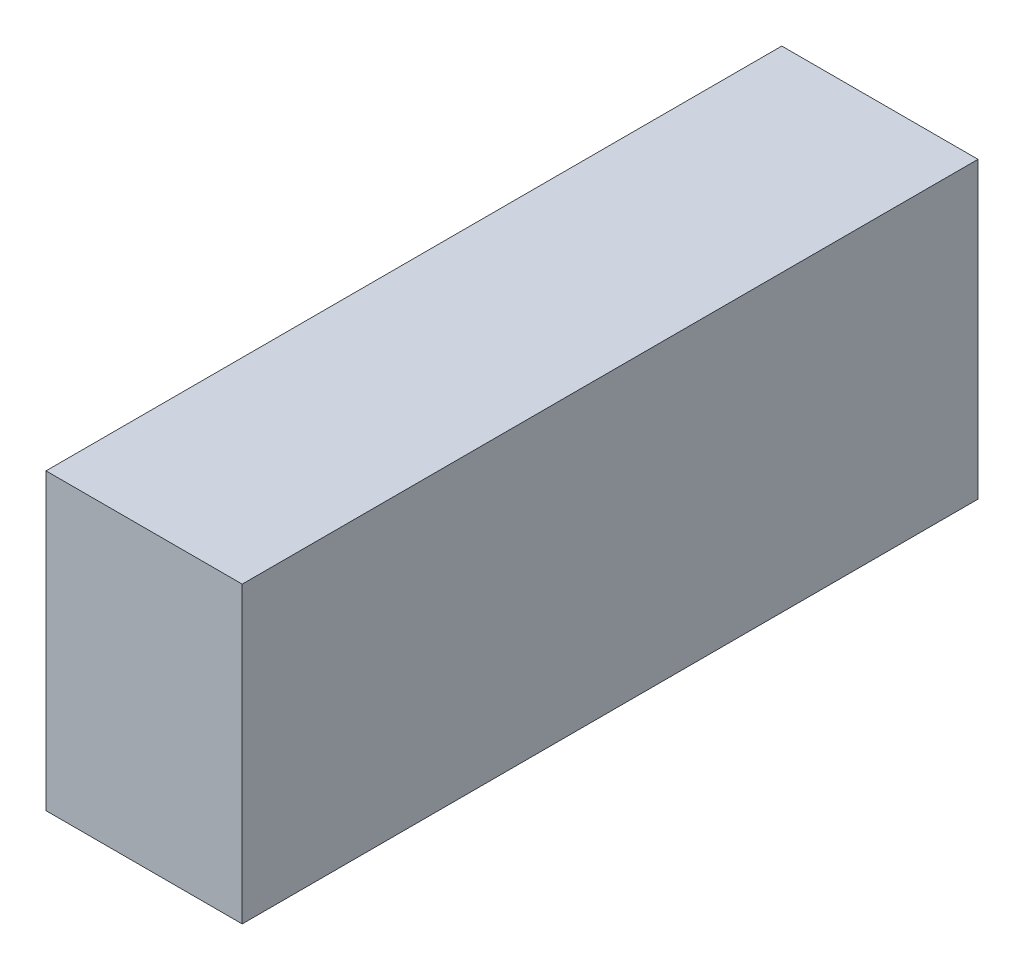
ISO-10303-21;
HEADER;
FILE_DESCRIPTION(('STEP AP214'),'2;1');
FILE_NAME('part.step','',(''),(''),'','','');
FILE_SCHEMA(('AUTOMOTIVE_DESIGN { 1 0 10303 214 1 1 1 1 }'));
ENDSEC;
DATA;
#1=APPLICATION_CONTEXT('core data for automotive mechanical design processes');
#2=APPLICATION_PROTOCOL_DEFINITION('international standard','automotive_design',2000,#1);
#3=PRODUCT_CONTEXT('',#1,'mechanical');
#4=PRODUCT('Part','Part','',(#3));
#5=PRODUCT_RELATED_PRODUCT_CATEGORY('part','',(#4));
#6=PRODUCT_DEFINITION_FORMATION('','',#4);
#7=PRODUCT_DEFINITION_CONTEXT('part definition',#1,'design');
#8=PRODUCT_DEFINITION('design','',#6,#7);
#9=PRODUCT_DEFINITION_SHAPE('','',#8);
#10=(LENGTH_UNIT() NAMED_UNIT(*) SI_UNIT(.MILLI.,.METRE.));
#11=(NAMED_UNIT(*) PLANE_ANGLE_UNIT() SI_UNIT($,.RADIAN.));
#12=(NAMED_UNIT(*) SI_UNIT($,.STERADIAN.) SOLID_ANGLE_UNIT());
#13=UNCERTAINTY_MEASURE_WITH_UNIT(LENGTH_MEASURE(1.E-05),#10,'distance_accuracy_value','');
#14=(GEOMETRIC_REPRESENTATION_CONTEXT(3) GLOBAL_UNCERTAINTY_ASSIGNED_CONTEXT((#13)) GLOBAL_UNIT_ASSIGNED_CONTEXT((#10,
#11,#12)) REPRESENTATION_CONTEXT('',''));
#15=CARTESIAN_POINT('',(0.,0.,0.));
#16=DIRECTION('',(0.,0.,1.));
#17=DIRECTION('',(1.,0.,0.));
#18=AXIS2_PLACEMENT_3D('',#15,#16,#17);
#19=CARTESIAN_POINT('',(0.,6.,0.));
#20=DIRECTION('',(1.,0.,0.));
#21=DIRECTION('',(0.,0.,-1.));
#22=AXIS2_PLACEMENT_3D('',#19,#20,#21);
#23=PLANE('',#22);
#24=DIRECTION('',(0.,0.,1.));
#25=VECTOR('',#24,1.);
#26=CARTESIAN_POINT('',(0.,0.,0.));
#27=LINE('',#26,#25);
#28=CARTESIAN_POINT('',(0.,0.,0.));
#29=VERTEX_POINT('',#28);
#30=CARTESIAN_POINT('',(0.,0.,15.));
#31=VERTEX_POINT('',#30);
#32=EDGE_CURVE('E98',#29,#31,#27,.T.);
#33=ORIENTED_EDGE('',*,*,#32,.T.);
#34=DIRECTION('',(0.,-1.,0.));
#35=VECTOR('',#34,1.);
#36=CARTESIAN_POINT('',(0.,6.,15.));
#37=LINE('',#36,#35);
#38=CARTESIAN_POINT('',(0.,6.,15.));
#39=VERTEX_POINT('',#38);
#40=EDGE_CURVE('E11',#39,#31,#37,.T.);
#41=ORIENTED_EDGE('',*,*,#40,.F.);
#42=DIRECTION('',(0.,0.,1.));
#43=VECTOR('',#42,1.);
#44=CARTESIAN_POINT('',(0.,6.,0.));
#45=LINE('',#44,#43);
#46=CARTESIAN_POINT('',(0.,6.,0.));
#47=VERTEX_POINT('',#46);
#48=EDGE_CURVE('E86',#47,#39,#45,.T.);
#49=ORIENTED_EDGE('',*,*,#48,.F.);
#50=DIRECTION('',(0.,-1.,0.));
#51=VECTOR('',#50,1.);
#52=CARTESIAN_POINT('',(0.,6.,0.));
#53=LINE('',#52,#51);
#54=EDGE_CURVE('E94',#47,#29,#53,.T.);
#55=ORIENTED_EDGE('',*,*,#54,.T.);
#56=EDGE_LOOP('',(#33,#41,#49,#55));
#57=FACE_BOUND('',#56,.T.);
#58=ADVANCED_FACE('F35',(#57),#23,.F.);
#59=CARTESIAN_POINT('',(0.,6.,15.));
#60=DIRECTION('',(0.,0.,-1.));
#61=DIRECTION('',(-1.,0.,0.));
#62=AXIS2_PLACEMENT_3D('',#59,#60,#61);
#63=PLANE('',#62);
#64=DIRECTION('',(1.,0.,0.));
#65=VECTOR('',#64,1.);
#66=CARTESIAN_POINT('',(0.,0.,15.));
#67=LINE('',#66,#65);
#68=CARTESIAN_POINT('',(4.,0.,15.));
#69=VERTEX_POINT('',#68);
#70=EDGE_CURVE('E90',#31,#69,#67,.T.);
#71=ORIENTED_EDGE('',*,*,#70,.T.);
#72=DIRECTION('',(0.,-1.,0.));
#73=VECTOR('',#72,1.);
#74=CARTESIAN_POINT('',(4.,6.,15.));
#75=LINE('',#74,#73);
#76=CARTESIAN_POINT('',(4.,6.,15.));
#77=VERTEX_POINT('',#76);
#78=EDGE_CURVE('E43',#77,#69,#75,.T.);
#79=ORIENTED_EDGE('',*,*,#78,.F.);
#80=DIRECTION('',(1.,0.,0.));
#81=VECTOR('',#80,1.);
#82=CARTESIAN_POINT('',(0.,6.,15.));
#83=LINE('',#82,#81);
#84=EDGE_CURVE('E81',#39,#77,#83,.T.);
#85=ORIENTED_EDGE('',*,*,#84,.F.);
#86=ORIENTED_EDGE('',*,*,#40,.T.);
#87=EDGE_LOOP('',(#71,#79,#85,#86));
#88=FACE_BOUND('',#87,.T.);
#89=ADVANCED_FACE('F89',(#88),#63,.F.);
#90=CARTESIAN_POINT('',(4.,6.,0.));
#91=DIRECTION('',(-1.,0.,0.));
#92=DIRECTION('',(0.,0.,1.));
#93=AXIS2_PLACEMENT_3D('',#90,#91,#92);
#94=PLANE('',#93);
#95=DIRECTION('',(0.,0.,-1.));
#96=VECTOR('',#95,1.);
#97=CARTESIAN_POINT('',(4.,0.,0.));
#98=LINE('',#97,#96);
#99=CARTESIAN_POINT('',(4.,0.,0.));
#100=VERTEX_POINT('',#99);
#101=EDGE_CURVE('E68',#69,#100,#98,.T.);
#102=ORIENTED_EDGE('',*,*,#101,.T.);
#103=DIRECTION('',(0.,-1.,0.));
#104=VECTOR('',#103,1.);
#105=CARTESIAN_POINT('',(4.,6.,0.));
#106=LINE('',#105,#104);
#107=CARTESIAN_POINT('',(4.,6.,0.));
#108=VERTEX_POINT('',#107);
#109=EDGE_CURVE('E91',#108,#100,#106,.T.);
#110=ORIENTED_EDGE('',*,*,#109,.F.);
#111=DIRECTION('',(0.,0.,-1.));
#112=VECTOR('',#111,1.);
#113=CARTESIAN_POINT('',(4.,6.,0.));
#114=LINE('',#113,#112);
#115=EDGE_CURVE('E84',#77,#108,#114,.T.);
#116=ORIENTED_EDGE('',*,*,#115,.F.);
#117=ORIENTED_EDGE('',*,*,#78,.T.);
#118=EDGE_LOOP('',(#102,#110,#116,#117));
#119=FACE_BOUND('',#118,.T.);
#120=ADVANCED_FACE('F92',(#119),#94,.F.);
#121=CARTESIAN_POINT('',(0.,6.,0.));
#122=DIRECTION('',(0.,0.,1.));
#123=DIRECTION('',(1.,0.,0.));
#124=AXIS2_PLACEMENT_3D('',#121,#122,#123);
#125=PLANE('',#124);
#126=DIRECTION('',(-1.,0.,0.));
#127=VECTOR('',#126,1.);
#128=CARTESIAN_POINT('',(0.,0.,0.));
#129=LINE('',#128,#127);
#130=EDGE_CURVE('E74',#100,#29,#129,.T.);
#131=ORIENTED_EDGE('',*,*,#130,.T.);
#132=ORIENTED_EDGE('',*,*,#54,.F.);
#133=DIRECTION('',(-1.,0.,0.));
#134=VECTOR('',#133,1.);
#135=CARTESIAN_POINT('',(0.,6.,0.));
#136=LINE('',#135,#134);
#137=EDGE_CURVE('E51',#108,#47,#136,.T.);
#138=ORIENTED_EDGE('',*,*,#137,.F.);
#139=ORIENTED_EDGE('',*,*,#109,.T.);
#140=EDGE_LOOP('',(#131,#132,#138,#139));
#141=FACE_BOUND('',#140,.T.);
#142=ADVANCED_FACE('F105',(#141),#125,.F.);
#143=CARTESIAN_POINT('',(0.,6.,0.));
#144=DIRECTION('',(0.,1.,0.));
#145=DIRECTION('',(0.,0.,1.));
#146=AXIS2_PLACEMENT_3D('',#143,#144,#145);
#147=PLANE('',#146);
#148=ORIENTED_EDGE('',*,*,#48,.T.);
#149=ORIENTED_EDGE('',*,*,#84,.T.);
#150=ORIENTED_EDGE('',*,*,#115,.T.);
#151=ORIENTED_EDGE('',*,*,#137,.T.);
#152=EDGE_LOOP('',(#148,#149,#150,#151));
#153=FACE_BOUND('',#152,.T.);
#154=ADVANCED_FACE('F82',(#153),#147,.T.);
#155=CARTESIAN_POINT('',(0.,0.,0.));
#156=DIRECTION('',(0.,1.,0.));
#157=DIRECTION('',(0.,0.,1.));
#158=AXIS2_PLACEMENT_3D('',#155,#156,#157);
#159=PLANE('',#158);
#160=ORIENTED_EDGE('',*,*,#32,.F.);
#161=ORIENTED_EDGE('',*,*,#130,.F.);
#162=ORIENTED_EDGE('',*,*,#101,.F.);
#163=ORIENTED_EDGE('',*,*,#70,.F.);
#164=EDGE_LOOP('',(#160,#161,#162,#163));
#165=FACE_BOUND('',#164,.T.);
#166=ADVANCED_FACE('F108',(#165),#159,.F.);
#167=CLOSED_SHELL('',(#58,#89,#120,#142,#154,#166));
#168=MANIFOLD_SOLID_BREP('B2',#167);
#169=ADVANCED_BREP_SHAPE_REPRESENTATION('',(#18,#168),#14);
#170=SHAPE_DEFINITION_REPRESENTATION(#9,#169);
ENDSEC;
END-ISO-10303-21;
